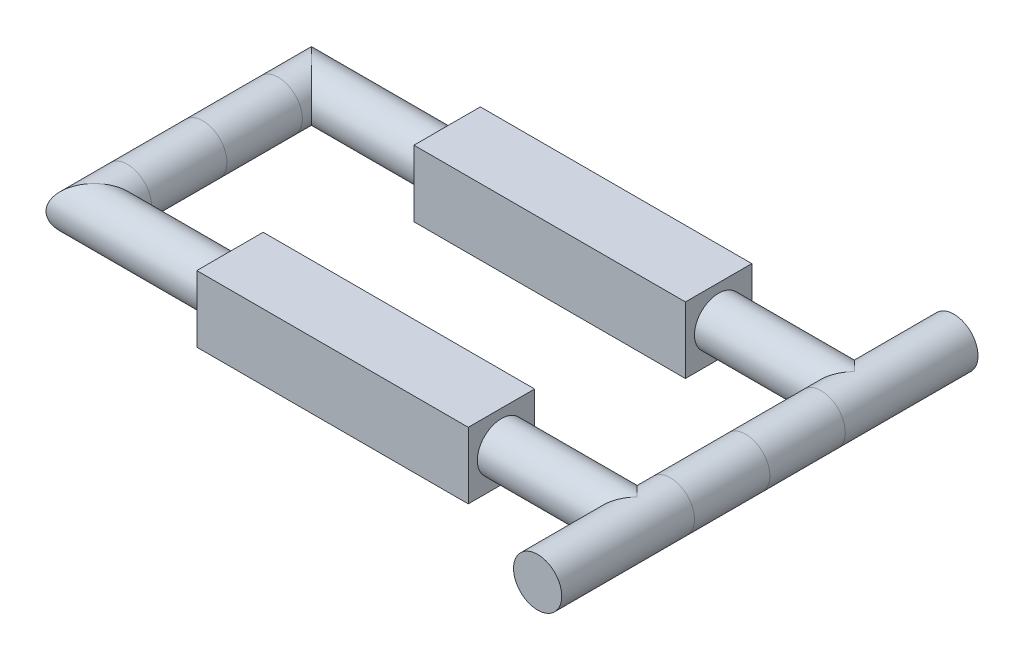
ISO-10303-21;
HEADER;
FILE_DESCRIPTION(('STEP AP214'),'2;1');
FILE_NAME('part.step','',(''),(''),'','','');
FILE_SCHEMA(('AUTOMOTIVE_DESIGN { 1 0 10303 214 1 1 1 1 }'));
ENDSEC;
DATA;
#1=APPLICATION_CONTEXT('core data for automotive mechanical design processes');
#2=APPLICATION_PROTOCOL_DEFINITION('international standard','automotive_design',2000,#1);
#3=PRODUCT_CONTEXT('',#1,'mechanical');
#4=PRODUCT('Part','Part','',(#3));
#5=PRODUCT_RELATED_PRODUCT_CATEGORY('part','',(#4));
#6=PRODUCT_DEFINITION_FORMATION('','',#4);
#7=PRODUCT_DEFINITION_CONTEXT('part definition',#1,'design');
#8=PRODUCT_DEFINITION('design','',#6,#7);
#9=PRODUCT_DEFINITION_SHAPE('','',#8);
#10=(LENGTH_UNIT() NAMED_UNIT(*) SI_UNIT(.MILLI.,.METRE.));
#11=(NAMED_UNIT(*) PLANE_ANGLE_UNIT() SI_UNIT($,.RADIAN.));
#12=(NAMED_UNIT(*) SI_UNIT($,.STERADIAN.) SOLID_ANGLE_UNIT());
#13=UNCERTAINTY_MEASURE_WITH_UNIT(LENGTH_MEASURE(1.E-05),#10,'distance_accuracy_value','');
#14=(GEOMETRIC_REPRESENTATION_CONTEXT(3) GLOBAL_UNCERTAINTY_ASSIGNED_CONTEXT((#13)) GLOBAL_UNIT_ASSIGNED_CONTEXT((#10,
#11,#12)) REPRESENTATION_CONTEXT('',''));
#15=CARTESIAN_POINT('',(0.,0.,0.));
#16=DIRECTION('',(0.,0.,1.));
#17=DIRECTION('',(1.,0.,0.));
#18=AXIS2_PLACEMENT_3D('',#15,#16,#17);
#19=CARTESIAN_POINT('',(-22.4520000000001,0.,91.44));
#20=DIRECTION('',(1.,0.,0.));
#21=DIRECTION('',(0.,0.,-1.));
#22=AXIS2_PLACEMENT_3D('',#19,#20,#21);
#23=CYLINDRICAL_SURFACE('',#22,20.32);
#24=CARTESIAN_POINT('',(0.,0.,91.44));
#25=DIRECTION('',(0.707106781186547,0.,0.707106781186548));
#26=DIRECTION('',(-0.707106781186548,0.,0.707106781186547));
#27=AXIS2_PLACEMENT_3D('',#24,#25,#26);
#28=ELLIPSE('',#27,28.7368195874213,20.32);
#29=CARTESIAN_POINT('',(-20.3200000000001,0.,111.76));
#30=VERTEX_POINT('',#29);
#31=EDGE_CURVE('E262',#30,#30,#28,.F.);
#32=ORIENTED_EDGE('',*,*,#31,.F.);
#33=EDGE_LOOP('',(#32));
#34=FACE_BOUND('',#33,.T.);
#35=CARTESIAN_POINT('',(114.3,0.,91.44));
#36=DIRECTION('',(1.,0.,0.));
#37=DIRECTION('',(0.,0.,-1.));
#38=AXIS2_PLACEMENT_3D('',#35,#36,#37);
#39=CIRCLE('',#38,20.32);
#40=CARTESIAN_POINT('',(114.3,0.,71.12));
#41=VERTEX_POINT('',#40);
#42=EDGE_CURVE('E252',#41,#41,#39,.T.);
#43=ORIENTED_EDGE('',*,*,#42,.F.);
#44=EDGE_LOOP('',(#43));
#45=FACE_BOUND('',#44,.T.);
#46=ADVANCED_FACE('F41',(#34,#45),#23,.T.);
#47=CARTESIAN_POINT('',(0.,0.,-113.892));
#48=DIRECTION('',(0.,0.,1.));
#49=DIRECTION('',(1.,0.,0.));
#50=AXIS2_PLACEMENT_3D('',#47,#48,#49);
#51=CYLINDRICAL_SURFACE('',#50,20.32);
#52=CARTESIAN_POINT('',(0.,0.,-91.44));
#53=DIRECTION('',(-0.707106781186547,0.,0.707106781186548));
#54=DIRECTION('',(-0.707106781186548,0.,-0.707106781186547));
#55=AXIS2_PLACEMENT_3D('',#52,#53,#54);
#56=ELLIPSE('',#55,28.7368195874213,20.32);
#57=CARTESIAN_POINT('',(-20.3200000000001,0.,-111.76));
#58=VERTEX_POINT('',#57);
#59=EDGE_CURVE('E147',#58,#58,#56,.F.);
#60=ORIENTED_EDGE('',*,*,#59,.F.);
#61=EDGE_LOOP('',(#60));
#62=FACE_BOUND('',#61,.T.);
#63=CARTESIAN_POINT('',(0.,0.,-63.5));
#64=DIRECTION('',(0.,0.,1.));
#65=DIRECTION('',(1.,0.,0.));
#66=AXIS2_PLACEMENT_3D('',#63,#64,#65);
#67=CIRCLE('',#66,20.32);
#68=CARTESIAN_POINT('',(20.32,0.,-63.5));
#69=VERTEX_POINT('',#68);
#70=EDGE_CURVE('E257',#69,#69,#67,.T.);
#71=ORIENTED_EDGE('',*,*,#70,.F.);
#72=EDGE_LOOP('',(#71));
#73=FACE_BOUND('',#72,.T.);
#74=ADVANCED_FACE('F279',(#62,#73),#51,.T.);
#75=CARTESIAN_POINT('',(0.,0.,-63.4999999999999));
#76=DIRECTION('',(0.,0.,1.));
#77=DIRECTION('',(1.,0.,0.));
#78=AXIS2_PLACEMENT_3D('',#75,#76,#77);
#79=CYLINDRICAL_SURFACE('',#78,20.32);
#80=CARTESIAN_POINT('',(0.,0.,0.));
#81=DIRECTION('',(0.,0.,1.));
#82=DIRECTION('',(1.,0.,0.));
#83=AXIS2_PLACEMENT_3D('',#80,#81,#82);
#84=CIRCLE('',#83,20.32);
#85=CARTESIAN_POINT('',(20.32,0.,0.));
#86=VERTEX_POINT('',#85);
#87=EDGE_CURVE('E261',#86,#86,#84,.T.);
#88=ORIENTED_EDGE('',*,*,#87,.F.);
#89=EDGE_LOOP('',(#88));
#90=FACE_BOUND('',#89,.T.);
#91=ORIENTED_EDGE('',*,*,#70,.T.);
#92=EDGE_LOOP('',(#91));
#93=FACE_BOUND('',#92,.T.);
#94=ADVANCED_FACE('F285',(#90,#93),#79,.T.);
#95=CARTESIAN_POINT('',(0.,0.,0.));
#96=DIRECTION('',(0.,0.,1.));
#97=DIRECTION('',(1.,0.,0.));
#98=AXIS2_PLACEMENT_3D('',#95,#96,#97);
#99=CYLINDRICAL_SURFACE('',#98,20.32);
#100=CARTESIAN_POINT('',(0.,0.,63.5));
#101=DIRECTION('',(0.,0.,1.));
#102=DIRECTION('',(1.,0.,0.));
#103=AXIS2_PLACEMENT_3D('',#100,#101,#102);
#104=CIRCLE('',#103,20.32);
#105=CARTESIAN_POINT('',(20.32,0.,63.4999999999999));
#106=VERTEX_POINT('',#105);
#107=EDGE_CURVE('E256',#106,#106,#104,.T.);
#108=ORIENTED_EDGE('',*,*,#107,.F.);
#109=EDGE_LOOP('',(#108));
#110=FACE_BOUND('',#109,.T.);
#111=ORIENTED_EDGE('',*,*,#87,.T.);
#112=EDGE_LOOP('',(#111));
#113=FACE_BOUND('',#112,.T.);
#114=ADVANCED_FACE('F301',(#110,#113),#99,.T.);
#115=CARTESIAN_POINT('',(0.,0.,63.5));
#116=DIRECTION('',(0.,0.,1.));
#117=DIRECTION('',(1.,0.,0.));
#118=AXIS2_PLACEMENT_3D('',#115,#116,#117);
#119=CYLINDRICAL_SURFACE('',#118,20.32);
#120=ORIENTED_EDGE('',*,*,#107,.T.);
#121=EDGE_LOOP('',(#120));
#122=FACE_BOUND('',#121,.T.);
#123=ORIENTED_EDGE('',*,*,#31,.T.);
#124=EDGE_LOOP('',(#123));
#125=FACE_BOUND('',#124,.T.);
#126=ADVANCED_FACE('F295',(#122,#125),#119,.T.);
#127=CARTESIAN_POINT('',(114.3,0.,-91.44));
#128=DIRECTION('',(-1.,0.,0.));
#129=DIRECTION('',(0.,0.,1.));
#130=AXIS2_PLACEMENT_3D('',#127,#128,#129);
#131=CYLINDRICAL_SURFACE('',#130,20.32);
#132=CARTESIAN_POINT('',(114.3,0.,-91.44));
#133=DIRECTION('',(-1.,0.,0.));
#134=DIRECTION('',(0.,0.,1.));
#135=AXIS2_PLACEMENT_3D('',#132,#133,#134);
#136=CIRCLE('',#135,20.32);
#137=CARTESIAN_POINT('',(114.3,0.,-71.12));
#138=VERTEX_POINT('',#137);
#139=EDGE_CURVE('E248',#138,#138,#136,.T.);
#140=ORIENTED_EDGE('',*,*,#139,.T.);
#141=EDGE_LOOP('',(#140));
#142=FACE_BOUND('',#141,.T.);
#143=ORIENTED_EDGE('',*,*,#59,.T.);
#144=EDGE_LOOP('',(#143));
#145=FACE_BOUND('',#144,.T.);
#146=ADVANCED_FACE('F291',(#142,#145),#131,.T.);
#147=CARTESIAN_POINT('',(342.9,-27.94,-119.38));
#148=DIRECTION('',(-1.,0.,0.));
#149=DIRECTION('',(0.,0.,1.));
#150=AXIS2_PLACEMENT_3D('',#147,#148,#149);
#151=PLANE('',#150);
#152=CARTESIAN_POINT('',(342.9,0.,-91.4400000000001));
#153=DIRECTION('',(-1.,0.,0.));
#154=DIRECTION('',(0.,0.,1.));
#155=AXIS2_PLACEMENT_3D('',#152,#153,#154);
#156=CIRCLE('',#155,20.32);
#157=CARTESIAN_POINT('',(342.9,0.,-71.1200000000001));
#158=VERTEX_POINT('',#157);
#159=EDGE_CURVE('E49',#158,#158,#156,.F.);
#160=ORIENTED_EDGE('',*,*,#159,.F.);
#161=EDGE_LOOP('',(#160));
#162=FACE_BOUND('',#161,.T.);
#163=DIRECTION('',(0.,1.,0.));
#164=VECTOR('',#163,1.);
#165=CARTESIAN_POINT('',(342.9,-27.94,-119.38));
#166=LINE('',#165,#164);
#167=CARTESIAN_POINT('',(342.9,-27.94,-119.38));
#168=VERTEX_POINT('',#167);
#169=CARTESIAN_POINT('',(342.9,27.94,-119.38));
#170=VERTEX_POINT('',#169);
#171=EDGE_CURVE('E236',#168,#170,#166,.T.);
#172=ORIENTED_EDGE('',*,*,#171,.T.);
#173=DIRECTION('',(0.,0.,1.));
#174=VECTOR('',#173,1.);
#175=CARTESIAN_POINT('',(342.9,27.94,-119.38));
#176=LINE('',#175,#174);
#177=CARTESIAN_POINT('',(342.9,27.94,-63.5));
#178=VERTEX_POINT('',#177);
#179=EDGE_CURVE('E206',#170,#178,#176,.T.);
#180=ORIENTED_EDGE('',*,*,#179,.T.);
#181=DIRECTION('',(0.,1.,0.));
#182=VECTOR('',#181,1.);
#183=CARTESIAN_POINT('',(342.9,-27.94,-63.5));
#184=LINE('',#183,#182);
#185=CARTESIAN_POINT('',(342.9,-27.94,-63.5));
#186=VERTEX_POINT('',#185);
#187=EDGE_CURVE('E245',#186,#178,#184,.T.);
#188=ORIENTED_EDGE('',*,*,#187,.F.);
#189=DIRECTION('',(0.,0.,1.));
#190=VECTOR('',#189,1.);
#191=CARTESIAN_POINT('',(342.9,-27.94,-119.38));
#192=LINE('',#191,#190);
#193=EDGE_CURVE('E222',#168,#186,#192,.T.);
#194=ORIENTED_EDGE('',*,*,#193,.F.);
#195=EDGE_LOOP('',(#172,#180,#188,#194));
#196=FACE_BOUND('',#195,.T.);
#197=ADVANCED_FACE('F281',(#162,#196),#151,.F.);
#198=CARTESIAN_POINT('',(342.9,-27.94,-63.5));
#199=DIRECTION('',(0.,0.,-1.));
#200=DIRECTION('',(-1.,0.,0.));
#201=AXIS2_PLACEMENT_3D('',#198,#199,#200);
#202=PLANE('',#201);
#203=ORIENTED_EDGE('',*,*,#187,.T.);
#204=DIRECTION('',(-1.,0.,0.));
#205=VECTOR('',#204,1.);
#206=CARTESIAN_POINT('',(342.9,27.94,-63.5));
#207=LINE('',#206,#205);
#208=CARTESIAN_POINT('',(114.3,27.94,-63.5));
#209=VERTEX_POINT('',#208);
#210=EDGE_CURVE('E210',#178,#209,#207,.T.);
#211=ORIENTED_EDGE('',*,*,#210,.T.);
#212=DIRECTION('',(0.,1.,0.));
#213=VECTOR('',#212,1.);
#214=CARTESIAN_POINT('',(114.3,-27.94,-63.5));
#215=LINE('',#214,#213);
#216=CARTESIAN_POINT('',(114.3,-27.94,-63.5));
#217=VERTEX_POINT('',#216);
#218=EDGE_CURVE('E242',#217,#209,#215,.T.);
#219=ORIENTED_EDGE('',*,*,#218,.F.);
#220=DIRECTION('',(-1.,0.,0.));
#221=VECTOR('',#220,1.);
#222=CARTESIAN_POINT('',(342.9,-27.94,-63.5));
#223=LINE('',#222,#221);
#224=EDGE_CURVE('E226',#186,#217,#223,.T.);
#225=ORIENTED_EDGE('',*,*,#224,.F.);
#226=EDGE_LOOP('',(#203,#211,#219,#225));
#227=FACE_BOUND('',#226,.T.);
#228=ADVANCED_FACE('F290',(#227),#202,.F.);
#229=CARTESIAN_POINT('',(114.3,-27.94,-91.44));
#230=DIRECTION('',(1.,0.,0.));
#231=DIRECTION('',(0.,0.,-1.));
#232=AXIS2_PLACEMENT_3D('',#229,#230,#231);
#233=PLANE('',#232);
#234=ORIENTED_EDGE('',*,*,#139,.F.);
#235=EDGE_LOOP('',(#234));
#236=FACE_BOUND('',#235,.T.);
#237=ORIENTED_EDGE('',*,*,#218,.T.);
#238=DIRECTION('',(0.,0.,1.));
#239=VECTOR('',#238,1.);
#240=CARTESIAN_POINT('',(114.3,27.94,-91.44));
#241=LINE('',#240,#239);
#242=CARTESIAN_POINT('',(114.3,27.94,-119.38));
#243=VERTEX_POINT('',#242);
#244=EDGE_CURVE('E214',#243,#209,#241,.T.);
#245=ORIENTED_EDGE('',*,*,#244,.F.);
#246=DIRECTION('',(0.,1.,0.));
#247=VECTOR('',#246,1.);
#248=CARTESIAN_POINT('',(114.3,-27.94,-119.38));
#249=LINE('',#248,#247);
#250=CARTESIAN_POINT('',(114.3,-27.94,-119.38));
#251=VERTEX_POINT('',#250);
#252=EDGE_CURVE('E239',#251,#243,#249,.T.);
#253=ORIENTED_EDGE('',*,*,#252,.F.);
#254=DIRECTION('',(0.,0.,1.));
#255=VECTOR('',#254,1.);
#256=CARTESIAN_POINT('',(114.3,-27.94,-91.44));
#257=LINE('',#256,#255);
#258=EDGE_CURVE('E229',#251,#217,#257,.T.);
#259=ORIENTED_EDGE('',*,*,#258,.T.);
#260=EDGE_LOOP('',(#237,#245,#253,#259));
#261=FACE_BOUND('',#260,.T.);
#262=ADVANCED_FACE('F340',(#236,#261),#233,.F.);
#263=CARTESIAN_POINT('',(114.3,-27.94,-119.38));
#264=DIRECTION('',(0.,0.,1.));
#265=DIRECTION('',(1.,0.,0.));
#266=AXIS2_PLACEMENT_3D('',#263,#264,#265);
#267=PLANE('',#266);
#268=ORIENTED_EDGE('',*,*,#252,.T.);
#269=DIRECTION('',(1.,0.,0.));
#270=VECTOR('',#269,1.);
#271=CARTESIAN_POINT('',(114.3,27.94,-119.38));
#272=LINE('',#271,#270);
#273=EDGE_CURVE('E218',#243,#170,#272,.T.);
#274=ORIENTED_EDGE('',*,*,#273,.T.);
#275=ORIENTED_EDGE('',*,*,#171,.F.);
#276=DIRECTION('',(1.,0.,0.));
#277=VECTOR('',#276,1.);
#278=CARTESIAN_POINT('',(114.3,-27.94,-119.38));
#279=LINE('',#278,#277);
#280=EDGE_CURVE('E233',#251,#168,#279,.T.);
#281=ORIENTED_EDGE('',*,*,#280,.F.);
#282=EDGE_LOOP('',(#268,#274,#275,#281));
#283=FACE_BOUND('',#282,.T.);
#284=ADVANCED_FACE('F350',(#283),#267,.F.);
#285=CARTESIAN_POINT('',(0.,-27.94,0.));
#286=DIRECTION('',(0.,-1.,0.));
#287=DIRECTION('',(0.,0.,-1.));
#288=AXIS2_PLACEMENT_3D('',#285,#286,#287);
#289=PLANE('',#288);
#290=ORIENTED_EDGE('',*,*,#193,.T.);
#291=ORIENTED_EDGE('',*,*,#224,.T.);
#292=ORIENTED_EDGE('',*,*,#258,.F.);
#293=ORIENTED_EDGE('',*,*,#280,.T.);
#294=EDGE_LOOP('',(#290,#291,#292,#293));
#295=FACE_BOUND('',#294,.T.);
#296=ADVANCED_FACE('F360',(#295),#289,.T.);
#297=CARTESIAN_POINT('',(0.,27.94,0.));
#298=DIRECTION('',(0.,-1.,0.));
#299=DIRECTION('',(0.,0.,-1.));
#300=AXIS2_PLACEMENT_3D('',#297,#298,#299);
#301=PLANE('',#300);
#302=ORIENTED_EDGE('',*,*,#179,.F.);
#303=ORIENTED_EDGE('',*,*,#273,.F.);
#304=ORIENTED_EDGE('',*,*,#244,.T.);
#305=ORIENTED_EDGE('',*,*,#210,.F.);
#306=EDGE_LOOP('',(#302,#303,#304,#305));
#307=FACE_BOUND('',#306,.T.);
#308=ADVANCED_FACE('F370',(#307),#301,.F.);
#309=CARTESIAN_POINT('',(114.3,-27.94,119.38));
#310=DIRECTION('',(0.,0.,1.));
#311=DIRECTION('',(1.,0.,0.));
#312=AXIS2_PLACEMENT_3D('',#309,#310,#311);
#313=PLANE('',#312);
#314=DIRECTION('',(0.,1.,0.));
#315=VECTOR('',#314,1.);
#316=CARTESIAN_POINT('',(342.9,-27.94,119.38));
#317=LINE('',#316,#315);
#318=CARTESIAN_POINT('',(342.9,-27.94,119.38));
#319=VERTEX_POINT('',#318);
#320=CARTESIAN_POINT('',(342.9,27.94,119.38));
#321=VERTEX_POINT('',#320);
#322=EDGE_CURVE('E164',#319,#321,#317,.T.);
#323=ORIENTED_EDGE('',*,*,#322,.T.);
#324=DIRECTION('',(1.,0.,0.));
#325=VECTOR('',#324,1.);
#326=CARTESIAN_POINT('',(114.3,27.94,119.38));
#327=LINE('',#326,#325);
#328=CARTESIAN_POINT('',(114.3,27.94,119.38));
#329=VERTEX_POINT('',#328);
#330=EDGE_CURVE('E202',#329,#321,#327,.T.);
#331=ORIENTED_EDGE('',*,*,#330,.F.);
#332=DIRECTION('',(0.,1.,0.));
#333=VECTOR('',#332,1.);
#334=CARTESIAN_POINT('',(114.3,-27.94,119.38));
#335=LINE('',#334,#333);
#336=CARTESIAN_POINT('',(114.3,-27.94,119.38));
#337=VERTEX_POINT('',#336);
#338=EDGE_CURVE('E118',#337,#329,#335,.T.);
#339=ORIENTED_EDGE('',*,*,#338,.F.);
#340=DIRECTION('',(1.,0.,0.));
#341=VECTOR('',#340,1.);
#342=CARTESIAN_POINT('',(114.3,-27.94,119.38));
#343=LINE('',#342,#341);
#344=EDGE_CURVE('E186',#337,#319,#343,.T.);
#345=ORIENTED_EDGE('',*,*,#344,.T.);
#346=EDGE_LOOP('',(#323,#331,#339,#345));
#347=FACE_BOUND('',#346,.T.);
#348=ADVANCED_FACE('F380',(#347),#313,.T.);
#349=CARTESIAN_POINT('',(114.3,-27.94,91.44));
#350=DIRECTION('',(-1.,0.,0.));
#351=DIRECTION('',(0.,0.,1.));
#352=AXIS2_PLACEMENT_3D('',#349,#350,#351);
#353=PLANE('',#352);
#354=ORIENTED_EDGE('',*,*,#42,.T.);
#355=EDGE_LOOP('',(#354));
#356=FACE_BOUND('',#355,.T.);
#357=ORIENTED_EDGE('',*,*,#338,.T.);
#358=DIRECTION('',(0.,0.,-1.));
#359=VECTOR('',#358,1.);
#360=CARTESIAN_POINT('',(114.3,27.94,91.44));
#361=LINE('',#360,#359);
#362=CARTESIAN_POINT('',(114.3,27.94,63.5));
#363=VERTEX_POINT('',#362);
#364=EDGE_CURVE('E190',#329,#363,#361,.T.);
#365=ORIENTED_EDGE('',*,*,#364,.T.);
#366=DIRECTION('',(0.,1.,0.));
#367=VECTOR('',#366,1.);
#368=CARTESIAN_POINT('',(114.3,-27.94,63.5));
#369=LINE('',#368,#367);
#370=CARTESIAN_POINT('',(114.3,-27.94,63.5));
#371=VERTEX_POINT('',#370);
#372=EDGE_CURVE('E171',#371,#363,#369,.T.);
#373=ORIENTED_EDGE('',*,*,#372,.F.);
#374=DIRECTION('',(0.,0.,-1.));
#375=VECTOR('',#374,1.);
#376=CARTESIAN_POINT('',(114.3,-27.94,91.44));
#377=LINE('',#376,#375);
#378=EDGE_CURVE('E167',#337,#371,#377,.T.);
#379=ORIENTED_EDGE('',*,*,#378,.F.);
#380=EDGE_LOOP('',(#357,#365,#373,#379));
#381=FACE_BOUND('',#380,.T.);
#382=ADVANCED_FACE('F275',(#356,#381),#353,.T.);
#383=CARTESIAN_POINT('',(342.9,-27.94,63.5));
#384=DIRECTION('',(0.,0.,-1.));
#385=DIRECTION('',(-1.,0.,0.));
#386=AXIS2_PLACEMENT_3D('',#383,#384,#385);
#387=PLANE('',#386);
#388=ORIENTED_EDGE('',*,*,#372,.T.);
#389=DIRECTION('',(-1.,0.,0.));
#390=VECTOR('',#389,1.);
#391=CARTESIAN_POINT('',(342.9,27.94,63.5));
#392=LINE('',#391,#390);
#393=CARTESIAN_POINT('',(342.9,27.94,63.5));
#394=VERTEX_POINT('',#393);
#395=EDGE_CURVE('E194',#394,#363,#392,.T.);
#396=ORIENTED_EDGE('',*,*,#395,.F.);
#397=DIRECTION('',(0.,1.,0.));
#398=VECTOR('',#397,1.);
#399=CARTESIAN_POINT('',(342.9,-27.94,63.5));
#400=LINE('',#399,#398);
#401=CARTESIAN_POINT('',(342.9,-27.94,63.5));
#402=VERTEX_POINT('',#401);
#403=EDGE_CURVE('E168',#402,#394,#400,.T.);
#404=ORIENTED_EDGE('',*,*,#403,.F.);
#405=DIRECTION('',(-1.,0.,0.));
#406=VECTOR('',#405,1.);
#407=CARTESIAN_POINT('',(342.9,-27.94,63.5));
#408=LINE('',#407,#406);
#409=EDGE_CURVE('E178',#402,#371,#408,.T.);
#410=ORIENTED_EDGE('',*,*,#409,.T.);
#411=EDGE_LOOP('',(#388,#396,#404,#410));
#412=FACE_BOUND('',#411,.T.);
#413=ADVANCED_FACE('F400',(#412),#387,.T.);
#414=CARTESIAN_POINT('',(342.9,-27.94,119.38));
#415=DIRECTION('',(1.,0.,0.));
#416=DIRECTION('',(0.,0.,-1.));
#417=AXIS2_PLACEMENT_3D('',#414,#415,#416);
#418=PLANE('',#417);
#419=CARTESIAN_POINT('',(342.9,0.,91.44));
#420=DIRECTION('',(1.,0.,0.));
#421=DIRECTION('',(0.,0.,-1.));
#422=AXIS2_PLACEMENT_3D('',#419,#420,#421);
#423=CIRCLE('',#422,20.32);
#424=CARTESIAN_POINT('',(342.9,0.,71.12));
#425=VERTEX_POINT('',#424);
#426=EDGE_CURVE('E140',#425,#425,#423,.F.);
#427=ORIENTED_EDGE('',*,*,#426,.T.);
#428=EDGE_LOOP('',(#427));
#429=FACE_BOUND('',#428,.T.);
#430=ORIENTED_EDGE('',*,*,#403,.T.);
#431=DIRECTION('',(0.,0.,-1.));
#432=VECTOR('',#431,1.);
#433=CARTESIAN_POINT('',(342.9,27.94,119.38));
#434=LINE('',#433,#432);
#435=EDGE_CURVE('E198',#321,#394,#434,.T.);
#436=ORIENTED_EDGE('',*,*,#435,.F.);
#437=ORIENTED_EDGE('',*,*,#322,.F.);
#438=DIRECTION('',(0.,0.,-1.));
#439=VECTOR('',#438,1.);
#440=CARTESIAN_POINT('',(342.9,-27.94,119.38));
#441=LINE('',#440,#439);
#442=EDGE_CURVE('E182',#319,#402,#441,.T.);
#443=ORIENTED_EDGE('',*,*,#442,.T.);
#444=EDGE_LOOP('',(#430,#436,#437,#443));
#445=FACE_BOUND('',#444,.T.);
#446=ADVANCED_FACE('F409',(#429,#445),#418,.T.);
#447=CARTESIAN_POINT('',(0.,-27.94,0.));
#448=DIRECTION('',(0.,1.,0.));
#449=DIRECTION('',(0.,0.,1.));
#450=AXIS2_PLACEMENT_3D('',#447,#448,#449);
#451=PLANE('',#450);
#452=ORIENTED_EDGE('',*,*,#344,.F.);
#453=ORIENTED_EDGE('',*,*,#378,.T.);
#454=ORIENTED_EDGE('',*,*,#409,.F.);
#455=ORIENTED_EDGE('',*,*,#442,.F.);
#456=EDGE_LOOP('',(#452,#453,#454,#455));
#457=FACE_BOUND('',#456,.T.);
#458=ADVANCED_FACE('F417',(#457),#451,.F.);
#459=CARTESIAN_POINT('',(0.,27.94,0.));
#460=DIRECTION('',(0.,1.,0.));
#461=DIRECTION('',(0.,0.,1.));
#462=AXIS2_PLACEMENT_3D('',#459,#460,#461);
#463=PLANE('',#462);
#464=ORIENTED_EDGE('',*,*,#330,.T.);
#465=ORIENTED_EDGE('',*,*,#435,.T.);
#466=ORIENTED_EDGE('',*,*,#395,.T.);
#467=ORIENTED_EDGE('',*,*,#364,.F.);
#468=EDGE_LOOP('',(#464,#465,#466,#467));
#469=FACE_BOUND('',#468,.T.);
#470=ADVANCED_FACE('F422',(#469),#463,.T.);
#471=CARTESIAN_POINT('',(479.652,0.,91.44));
#472=DIRECTION('',(-1.,0.,0.));
#473=DIRECTION('',(0.,0.,1.));
#474=AXIS2_PLACEMENT_3D('',#471,#472,#473);
#475=CYLINDRICAL_SURFACE('',#474,20.32);
#476=CARTESIAN_POINT('',(457.2,0.,91.44));
#477=DIRECTION('',(-0.707106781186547,0.,-0.707106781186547));
#478=DIRECTION('',(-0.707106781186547,0.,0.707106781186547));
#479=AXIS2_PLACEMENT_3D('',#476,#477,#478);
#480=ELLIPSE('',#479,28.7368195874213,20.32);
#481=CARTESIAN_POINT('',(457.2,20.32,91.4400000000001));
#482=VERTEX_POINT('',#481);
#483=CARTESIAN_POINT('',(457.2,-20.32,91.44));
#484=VERTEX_POINT('',#483);
#485=EDGE_CURVE('E55',#482,#484,#480,.F.);
#486=ORIENTED_EDGE('',*,*,#485,.F.);
#487=CARTESIAN_POINT('',(457.2,0.,91.4400000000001));
#488=DIRECTION('',(-0.707106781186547,0.,0.707106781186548));
#489=DIRECTION('',(0.707106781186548,0.,0.707106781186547));
#490=AXIS2_PLACEMENT_3D('',#487,#488,#489);
#491=ELLIPSE('',#490,28.7368195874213,20.32);
#492=EDGE_CURVE('E152',#484,#482,#491,.F.);
#493=ORIENTED_EDGE('',*,*,#492,.F.);
#494=EDGE_LOOP('',(#486,#493));
#495=FACE_BOUND('',#494,.T.);
#496=ORIENTED_EDGE('',*,*,#426,.F.);
#497=EDGE_LOOP('',(#496));
#498=FACE_BOUND('',#497,.T.);
#499=ADVANCED_FACE('F125',(#495,#498),#475,.T.);
#500=CARTESIAN_POINT('',(457.2,0.,-113.892));
#501=DIRECTION('',(0.,0.,1.));
#502=DIRECTION('',(1.,0.,0.));
#503=AXIS2_PLACEMENT_3D('',#500,#501,#502);
#504=CYLINDRICAL_SURFACE('',#503,20.32);
#505=CARTESIAN_POINT('',(457.2,0.,-91.4400000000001));
#506=DIRECTION('',(0.707106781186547,0.,0.707106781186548));
#507=DIRECTION('',(0.707106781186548,0.,-0.707106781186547));
#508=AXIS2_PLACEMENT_3D('',#505,#506,#507);
#509=ELLIPSE('',#508,28.7368195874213,20.32);
#510=CARTESIAN_POINT('',(457.2,-20.32,-91.4400000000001));
#511=VERTEX_POINT('',#510);
#512=CARTESIAN_POINT('',(457.2,20.32,-91.4400000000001));
#513=VERTEX_POINT('',#512);
#514=EDGE_CURVE('E113',#511,#513,#509,.F.);
#515=ORIENTED_EDGE('',*,*,#514,.F.);
#516=CARTESIAN_POINT('',(457.2,0.,-91.4400000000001));
#517=DIRECTION('',(0.707106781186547,0.,-0.707106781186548));
#518=DIRECTION('',(0.707106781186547,0.,0.707106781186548));
#519=AXIS2_PLACEMENT_3D('',#516,#517,#518);
#520=ELLIPSE('',#519,28.7368195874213,20.32);
#521=EDGE_CURVE('E11',#511,#513,#520,.T.);
#522=ORIENTED_EDGE('',*,*,#521,.T.);
#523=EDGE_LOOP('',(#515,#522));
#524=FACE_BOUND('',#523,.T.);
#525=CARTESIAN_POINT('',(457.2,0.,-63.5));
#526=DIRECTION('',(0.,0.,-1.));
#527=DIRECTION('',(-1.,0.,0.));
#528=AXIS2_PLACEMENT_3D('',#525,#526,#527);
#529=CIRCLE('',#528,20.32);
#530=CARTESIAN_POINT('',(436.88,0.,-63.5));
#531=VERTEX_POINT('',#530);
#532=EDGE_CURVE('E130',#531,#531,#529,.F.);
#533=ORIENTED_EDGE('',*,*,#532,.F.);
#534=EDGE_LOOP('',(#533));
#535=FACE_BOUND('',#534,.T.);
#536=CARTESIAN_POINT('',(457.2,0.,-175.26));
#537=DIRECTION('',(0.,0.,1.));
#538=DIRECTION('',(1.,0.,0.));
#539=AXIS2_PLACEMENT_3D('',#536,#537,#538);
#540=CIRCLE('',#539,20.32);
#541=CARTESIAN_POINT('',(477.52,0.,-175.26));
#542=VERTEX_POINT('',#541);
#543=EDGE_CURVE('E133',#542,#542,#540,.T.);
#544=ORIENTED_EDGE('',*,*,#543,.T.);
#545=EDGE_LOOP('',(#544));
#546=FACE_BOUND('',#545,.T.);
#547=ADVANCED_FACE('F121',(#524,#535,#546),#504,.T.);
#548=CARTESIAN_POINT('',(457.2,0.,-63.4999999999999));
#549=DIRECTION('',(0.,0.,1.));
#550=DIRECTION('',(1.,0.,0.));
#551=AXIS2_PLACEMENT_3D('',#548,#549,#550);
#552=CYLINDRICAL_SURFACE('',#551,20.32);
#553=CARTESIAN_POINT('',(457.2,0.,0.));
#554=DIRECTION('',(0.,0.,-1.));
#555=DIRECTION('',(-1.,0.,0.));
#556=AXIS2_PLACEMENT_3D('',#553,#554,#555);
#557=CIRCLE('',#556,20.32);
#558=CARTESIAN_POINT('',(436.88,0.,0.));
#559=VERTEX_POINT('',#558);
#560=EDGE_CURVE('E151',#559,#559,#557,.F.);
#561=ORIENTED_EDGE('',*,*,#560,.F.);
#562=EDGE_LOOP('',(#561));
#563=FACE_BOUND('',#562,.T.);
#564=ORIENTED_EDGE('',*,*,#532,.T.);
#565=EDGE_LOOP('',(#564));
#566=FACE_BOUND('',#565,.T.);
#567=ADVANCED_FACE('F124',(#563,#566),#552,.T.);
#568=CARTESIAN_POINT('',(457.2,0.,0.));
#569=DIRECTION('',(0.,0.,1.));
#570=DIRECTION('',(1.,0.,0.));
#571=AXIS2_PLACEMENT_3D('',#568,#569,#570);
#572=CYLINDRICAL_SURFACE('',#571,20.32);
#573=CARTESIAN_POINT('',(457.2,0.,63.4999999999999));
#574=DIRECTION('',(0.,0.,-1.));
#575=DIRECTION('',(-1.,0.,0.));
#576=AXIS2_PLACEMENT_3D('',#573,#574,#575);
#577=CIRCLE('',#576,20.32);
#578=CARTESIAN_POINT('',(436.88,0.,63.4999999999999));
#579=VERTEX_POINT('',#578);
#580=EDGE_CURVE('E119',#579,#579,#577,.F.);
#581=ORIENTED_EDGE('',*,*,#580,.F.);
#582=EDGE_LOOP('',(#581));
#583=FACE_BOUND('',#582,.T.);
#584=ORIENTED_EDGE('',*,*,#560,.T.);
#585=EDGE_LOOP('',(#584));
#586=FACE_BOUND('',#585,.T.);
#587=ADVANCED_FACE('F455',(#583,#586),#572,.T.);
#588=CARTESIAN_POINT('',(457.2,0.,63.5));
#589=DIRECTION('',(0.,0.,1.));
#590=DIRECTION('',(1.,0.,0.));
#591=AXIS2_PLACEMENT_3D('',#588,#589,#590);
#592=CYLINDRICAL_SURFACE('',#591,20.32);
#593=ORIENTED_EDGE('',*,*,#580,.T.);
#594=EDGE_LOOP('',(#593));
#595=FACE_BOUND('',#594,.T.);
#596=ORIENTED_EDGE('',*,*,#492,.T.);
#597=ORIENTED_EDGE('',*,*,#485,.T.);
#598=EDGE_LOOP('',(#596,#597));
#599=FACE_BOUND('',#598,.T.);
#600=CARTESIAN_POINT('',(457.2,0.,175.26));
#601=DIRECTION('',(0.,0.,1.));
#602=DIRECTION('',(1.,0.,0.));
#603=AXIS2_PLACEMENT_3D('',#600,#601,#602);
#604=CIRCLE('',#603,20.32);
#605=CARTESIAN_POINT('',(477.52,0.,175.26));
#606=VERTEX_POINT('',#605);
#607=EDGE_CURVE('E136',#606,#606,#604,.T.);
#608=ORIENTED_EDGE('',*,*,#607,.F.);
#609=EDGE_LOOP('',(#608));
#610=FACE_BOUND('',#609,.T.);
#611=ADVANCED_FACE('F466',(#595,#599,#610),#592,.T.);
#612=CARTESIAN_POINT('',(342.9,0.,-91.4400000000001));
#613=DIRECTION('',(1.,0.,0.));
#614=DIRECTION('',(0.,0.,-1.));
#615=AXIS2_PLACEMENT_3D('',#612,#613,#614);
#616=CYLINDRICAL_SURFACE('',#615,20.32);
#617=ORIENTED_EDGE('',*,*,#521,.F.);
#618=ORIENTED_EDGE('',*,*,#514,.T.);
#619=EDGE_LOOP('',(#617,#618));
#620=FACE_BOUND('',#619,.T.);
#621=ORIENTED_EDGE('',*,*,#159,.T.);
#622=EDGE_LOOP('',(#621));
#623=FACE_BOUND('',#622,.T.);
#624=ADVANCED_FACE('F114',(#620,#623),#616,.T.);
#625=CARTESIAN_POINT('',(457.2,0.,-175.26));
#626=DIRECTION('',(0.,0.,1.));
#627=DIRECTION('',(1.,0.,0.));
#628=AXIS2_PLACEMENT_3D('',#625,#626,#627);
#629=PLANE('',#628);
#630=ORIENTED_EDGE('',*,*,#543,.F.);
#631=EDGE_LOOP('',(#630));
#632=FACE_BOUND('',#631,.T.);
#633=ADVANCED_FACE('F477',(#632),#629,.F.);
#634=CARTESIAN_POINT('',(457.2,0.,175.26));
#635=DIRECTION('',(0.,0.,1.));
#636=DIRECTION('',(1.,0.,0.));
#637=AXIS2_PLACEMENT_3D('',#634,#635,#636);
#638=PLANE('',#637);
#639=ORIENTED_EDGE('',*,*,#607,.T.);
#640=EDGE_LOOP('',(#639));
#641=FACE_BOUND('',#640,.T.);
#642=ADVANCED_FACE('F507',(#641),#638,.T.);
#643=CLOSED_SHELL('',(#46,#74,#94,#114,#126,#146,#197,#228,#262,#284,#296,#308,#348,#382,#413,
#446,#458,#470,#499,#547,#567,#587,#611,#624,#633,#642));
#644=MANIFOLD_SOLID_BREP('B2',#643);
#645=ADVANCED_BREP_SHAPE_REPRESENTATION('',(#18,#644),#14);
#646=SHAPE_DEFINITION_REPRESENTATION(#9,#645);
ENDSEC;
END-ISO-10303-21;
